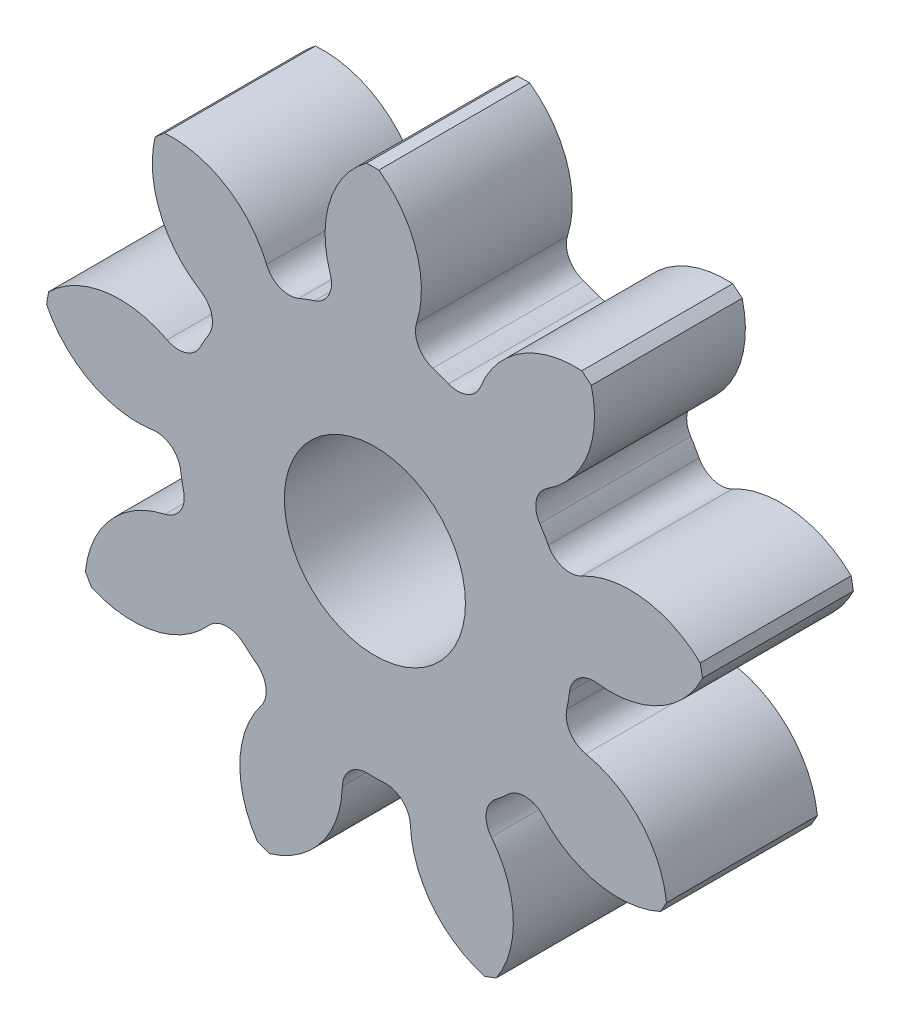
from build123d import *

# Parameters (mm, degrees)
SKETCH3_R         = 279.4
GEARBODY_DEPTH    = 127
TOOTHCUT_DEPTH    = 416.039419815
CIRPATTERN1_COUNT = 9
BOREDIA_R         = 76.2
BORE_DEPTH        = 12700


with BuildPart() as part:
    # Sketch3 → gearBody (new body)
    with BuildSketch(Plane.XY):
        Circle(SKETCH3_R)
    extrude(amount=GEARBODY_DEPTH)

    # Sketch2 → toothCut (cut, through all)
    with BuildSketch(Plane.XY):
        with BuildLine():
            ThreePointArc((161.448383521, -34.531571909), (162.779681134, -27.582338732), (163.812004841, -20.582445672))
            ThreePointArc((163.812004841, -20.582445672), (171.711561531, -6.778651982), (187.075486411, -2.667991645))
            ThreePointArc((187.075486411, -2.667991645), (243.394221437, 9.306509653), (279.4, 54.237261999))
            ThreePointArc((279.4, 54.237261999), (280.615607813, -47.549145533), (245.936052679, -143.253267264))
            ThreePointArc((245.936052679, -143.253267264), (226.741828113, -88.969104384), (177.511660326, -59.109781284))
            ThreePointArc((177.511660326, -59.109781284), (164.359553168, -50.167198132), (161.448383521, -34.531571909))
        make_face()
    toothcut = extrude(amount=TOOTHCUT_DEPTH, mode=Mode.SUBTRACT)

    # CirPattern1: toothCut ×9 about axis
    cirpattern1_axis = Axis((0, 0, 0), (0, 0, 1))
    for i in range(1, CIRPATTERN1_COUNT):
        add(toothcut.rotate(cirpattern1_axis, i * 360 / CIRPATTERN1_COUNT), mode=Mode.SUBTRACT)

    # boreDia → bore (cut, symmetric)
    with BuildSketch(Plane.XY):
        Circle(BOREDIA_R)
    extrude(amount=BORE_DEPTH, both=True, mode=Mode.SUBTRACT)


solid = part.part
